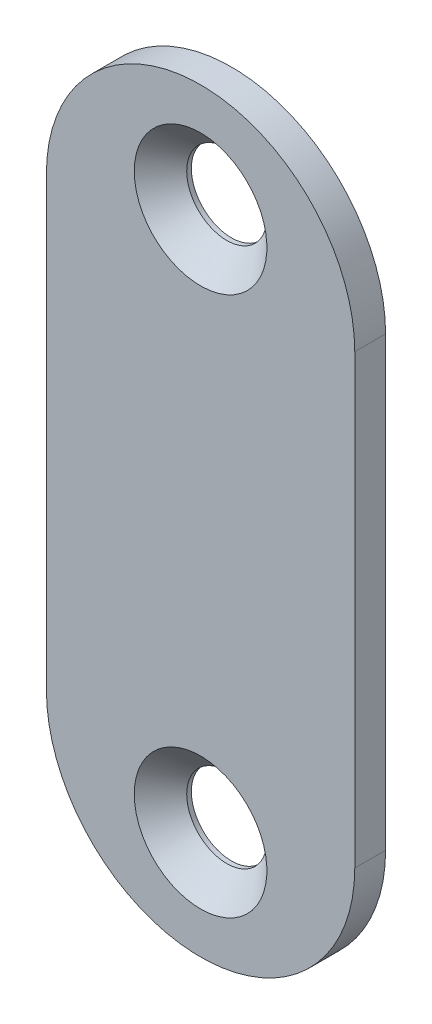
from build123d import *

# Parameters (mm, degrees)
EXTRUDE_1_DEPTH = 2


with BuildPart() as part:
    # Sketch 1 → Extrude 1 (new body)
    with BuildSketch(Plane.XY):
        with BuildLine():
            Line((10, -14.5), (10, 14.5))
            ThreePointArc((10, 14.5), (0, 24.5), (-10, 14.5))
            Line((-10, 14.5), (-10, -14.5))
            ThreePointArc((-10, -14.5), (0, -24.5), (10, -14.5))
        make_face()
    extrude(amount=-EXTRUDE_1_DEPTH)

    # Sketch 2 → Cut-Revolve 1 (revolve, cut)
    with BuildSketch(Plane(origin=(0, 0, 0), x_dir=(0, 0, -1), z_dir=(1, 0, 0)), mode=Mode.PRIVATE) as cut_revolve_1_sk:
        Polygon((3, 17.5), (3, 14.9), (1.7, 14.9), (0, 13.2), (0, 17.5), align=None)
    revolve(cut_revolve_1_sk.sketch.rotate(Axis((0, 17.5, 0), (0, 0, -1)), 90), axis=Axis((0, 17.5, 0), (0, 0, -1)), mode=Mode.SUBTRACT)

    # Sketch 3 → Cut-Revolve 2 (revolve, cut)
    with BuildSketch(Plane(origin=(0, 0, 0), x_dir=(0, 0, -1), z_dir=(1, 0, 0)), mode=Mode.PRIVATE) as cut_revolve_2_sk:
        Polygon((3, -17.5), (3, -20.1), (1.7, -20.1), (0, -21.8), (0, -17.5), align=None)
    revolve(cut_revolve_2_sk.sketch.rotate(Axis((0, -17.5, 0), (0, 0, -1)), 90), axis=Axis((0, -17.5, 0), (0, 0, -1)), mode=Mode.SUBTRACT)


solid = part.part
